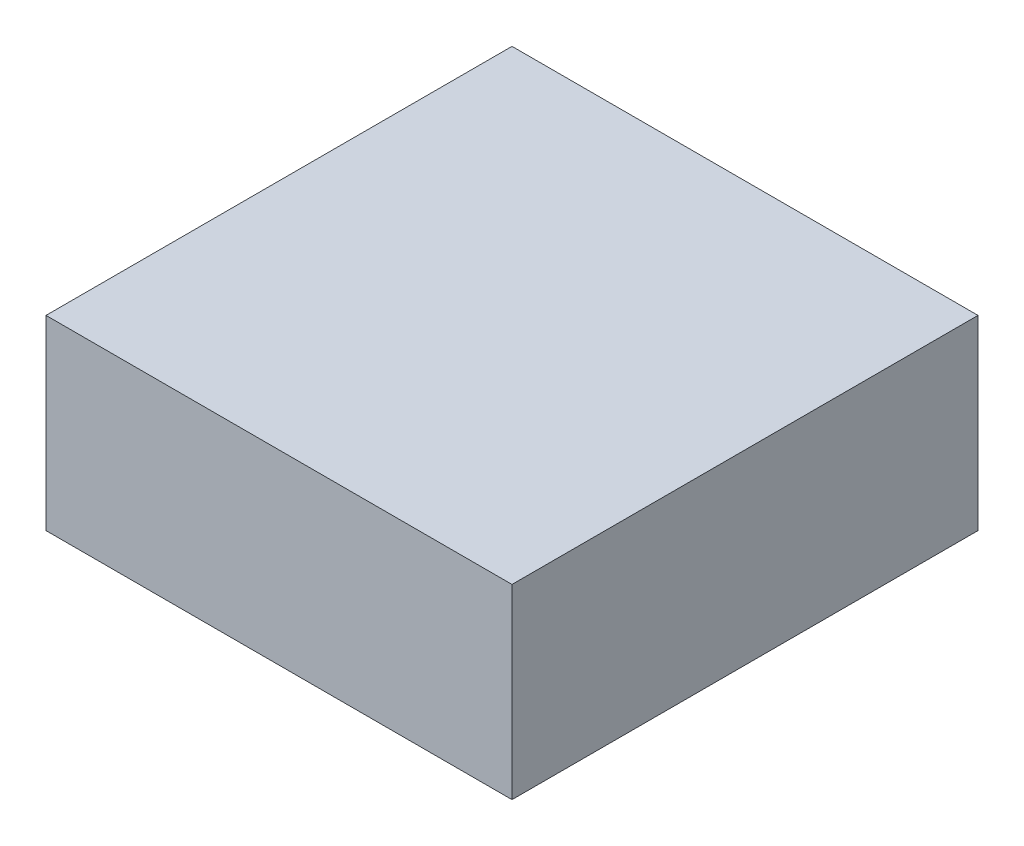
ISO-10303-21;
HEADER;
FILE_DESCRIPTION(('STEP AP214'),'2;1');
FILE_NAME('part.step','',(''),(''),'','','');
FILE_SCHEMA(('AUTOMOTIVE_DESIGN { 1 0 10303 214 1 1 1 1 }'));
ENDSEC;
DATA;
#1=APPLICATION_CONTEXT('core data for automotive mechanical design processes');
#2=APPLICATION_PROTOCOL_DEFINITION('international standard','automotive_design',2000,#1);
#3=PRODUCT_CONTEXT('',#1,'mechanical');
#4=PRODUCT('Part','Part','',(#3));
#5=PRODUCT_RELATED_PRODUCT_CATEGORY('part','',(#4));
#6=PRODUCT_DEFINITION_FORMATION('','',#4);
#7=PRODUCT_DEFINITION_CONTEXT('part definition',#1,'design');
#8=PRODUCT_DEFINITION('design','',#6,#7);
#9=PRODUCT_DEFINITION_SHAPE('','',#8);
#10=(LENGTH_UNIT() NAMED_UNIT(*) SI_UNIT(.MILLI.,.METRE.));
#11=(NAMED_UNIT(*) PLANE_ANGLE_UNIT() SI_UNIT($,.RADIAN.));
#12=(NAMED_UNIT(*) SI_UNIT($,.STERADIAN.) SOLID_ANGLE_UNIT());
#13=UNCERTAINTY_MEASURE_WITH_UNIT(LENGTH_MEASURE(1.E-05),#10,'distance_accuracy_value','');
#14=(GEOMETRIC_REPRESENTATION_CONTEXT(3) GLOBAL_UNCERTAINTY_ASSIGNED_CONTEXT((#13)) GLOBAL_UNIT_ASSIGNED_CONTEXT((#10,
#11,#12)) REPRESENTATION_CONTEXT('',''));
#15=CARTESIAN_POINT('',(0.,0.,0.));
#16=DIRECTION('',(0.,0.,1.));
#17=DIRECTION('',(1.,0.,0.));
#18=AXIS2_PLACEMENT_3D('',#15,#16,#17);
#19=CARTESIAN_POINT('',(-25.,20.,-25.));
#20=DIRECTION('',(1.,0.,0.));
#21=DIRECTION('',(0.,0.,-1.));
#22=AXIS2_PLACEMENT_3D('',#19,#20,#21);
#23=PLANE('',#22);
#24=DIRECTION('',(0.,0.,1.));
#25=VECTOR('',#24,1.);
#26=CARTESIAN_POINT('',(-25.,0.,-25.));
#27=LINE('',#26,#25);
#28=CARTESIAN_POINT('',(-25.,0.,-25.));
#29=VERTEX_POINT('',#28);
#30=CARTESIAN_POINT('',(-25.,0.,25.));
#31=VERTEX_POINT('',#30);
#32=EDGE_CURVE('E76',#29,#31,#27,.T.);
#33=ORIENTED_EDGE('',*,*,#32,.T.);
#34=DIRECTION('',(0.,-1.,0.));
#35=VECTOR('',#34,1.);
#36=CARTESIAN_POINT('',(-25.,20.,25.));
#37=LINE('',#36,#35);
#38=CARTESIAN_POINT('',(-25.,20.,25.));
#39=VERTEX_POINT('',#38);
#40=EDGE_CURVE('E11',#39,#31,#37,.T.);
#41=ORIENTED_EDGE('',*,*,#40,.F.);
#42=DIRECTION('',(0.,0.,1.));
#43=VECTOR('',#42,1.);
#44=CARTESIAN_POINT('',(-25.,20.,-25.));
#45=LINE('',#44,#43);
#46=CARTESIAN_POINT('',(-25.,20.,-25.));
#47=VERTEX_POINT('',#46);
#48=EDGE_CURVE('E94',#47,#39,#45,.T.);
#49=ORIENTED_EDGE('',*,*,#48,.F.);
#50=DIRECTION('',(0.,-1.,0.));
#51=VECTOR('',#50,1.);
#52=CARTESIAN_POINT('',(-25.,20.,-25.));
#53=LINE('',#52,#51);
#54=EDGE_CURVE('E88',#47,#29,#53,.T.);
#55=ORIENTED_EDGE('',*,*,#54,.T.);
#56=EDGE_LOOP('',(#33,#41,#49,#55));
#57=FACE_BOUND('',#56,.T.);
#58=ADVANCED_FACE('F32',(#57),#23,.F.);
#59=CARTESIAN_POINT('',(-25.,20.,25.));
#60=DIRECTION('',(0.,0.,-1.));
#61=DIRECTION('',(-1.,0.,0.));
#62=AXIS2_PLACEMENT_3D('',#59,#60,#61);
#63=PLANE('',#62);
#64=DIRECTION('',(1.,0.,0.));
#65=VECTOR('',#64,1.);
#66=CARTESIAN_POINT('',(-25.,0.,25.));
#67=LINE('',#66,#65);
#68=CARTESIAN_POINT('',(25.,0.,25.));
#69=VERTEX_POINT('',#68);
#70=EDGE_CURVE('E72',#31,#69,#67,.T.);
#71=ORIENTED_EDGE('',*,*,#70,.T.);
#72=DIRECTION('',(0.,-1.,0.));
#73=VECTOR('',#72,1.);
#74=CARTESIAN_POINT('',(25.,20.,25.));
#75=LINE('',#74,#73);
#76=CARTESIAN_POINT('',(25.,20.,25.));
#77=VERTEX_POINT('',#76);
#78=EDGE_CURVE('E39',#77,#69,#75,.T.);
#79=ORIENTED_EDGE('',*,*,#78,.F.);
#80=DIRECTION('',(1.,0.,0.));
#81=VECTOR('',#80,1.);
#82=CARTESIAN_POINT('',(-25.,20.,25.));
#83=LINE('',#82,#81);
#84=EDGE_CURVE('E84',#39,#77,#83,.T.);
#85=ORIENTED_EDGE('',*,*,#84,.F.);
#86=ORIENTED_EDGE('',*,*,#40,.T.);
#87=EDGE_LOOP('',(#71,#79,#85,#86));
#88=FACE_BOUND('',#87,.T.);
#89=ADVANCED_FACE('F83',(#88),#63,.F.);
#90=CARTESIAN_POINT('',(25.,20.,-25.));
#91=DIRECTION('',(-1.,0.,0.));
#92=DIRECTION('',(0.,0.,1.));
#93=AXIS2_PLACEMENT_3D('',#90,#91,#92);
#94=PLANE('',#93);
#95=DIRECTION('',(0.,0.,-1.));
#96=VECTOR('',#95,1.);
#97=CARTESIAN_POINT('',(25.,0.,-25.));
#98=LINE('',#97,#96);
#99=CARTESIAN_POINT('',(25.,0.,-25.));
#100=VERTEX_POINT('',#99);
#101=EDGE_CURVE('E77',#69,#100,#98,.T.);
#102=ORIENTED_EDGE('',*,*,#101,.T.);
#103=DIRECTION('',(0.,-1.,0.));
#104=VECTOR('',#103,1.);
#105=CARTESIAN_POINT('',(25.,20.,-25.));
#106=LINE('',#105,#104);
#107=CARTESIAN_POINT('',(25.,20.,-25.));
#108=VERTEX_POINT('',#107);
#109=EDGE_CURVE('E100',#108,#100,#106,.T.);
#110=ORIENTED_EDGE('',*,*,#109,.F.);
#111=DIRECTION('',(0.,0.,-1.));
#112=VECTOR('',#111,1.);
#113=CARTESIAN_POINT('',(25.,20.,-25.));
#114=LINE('',#113,#112);
#115=EDGE_CURVE('E51',#77,#108,#114,.T.);
#116=ORIENTED_EDGE('',*,*,#115,.F.);
#117=ORIENTED_EDGE('',*,*,#78,.T.);
#118=EDGE_LOOP('',(#102,#110,#116,#117));
#119=FACE_BOUND('',#118,.T.);
#120=ADVANCED_FACE('F103',(#119),#94,.F.);
#121=CARTESIAN_POINT('',(-25.,20.,-25.));
#122=DIRECTION('',(0.,0.,1.));
#123=DIRECTION('',(1.,0.,0.));
#124=AXIS2_PLACEMENT_3D('',#121,#122,#123);
#125=PLANE('',#124);
#126=DIRECTION('',(-1.,0.,0.));
#127=VECTOR('',#126,1.);
#128=CARTESIAN_POINT('',(-25.,0.,-25.));
#129=LINE('',#128,#127);
#130=EDGE_CURVE('E92',#100,#29,#129,.T.);
#131=ORIENTED_EDGE('',*,*,#130,.T.);
#132=ORIENTED_EDGE('',*,*,#54,.F.);
#133=DIRECTION('',(-1.,0.,0.));
#134=VECTOR('',#133,1.);
#135=CARTESIAN_POINT('',(-25.,20.,-25.));
#136=LINE('',#135,#134);
#137=EDGE_CURVE('E46',#108,#47,#136,.T.);
#138=ORIENTED_EDGE('',*,*,#137,.F.);
#139=ORIENTED_EDGE('',*,*,#109,.T.);
#140=EDGE_LOOP('',(#131,#132,#138,#139));
#141=FACE_BOUND('',#140,.T.);
#142=ADVANCED_FACE('F105',(#141),#125,.F.);
#143=CARTESIAN_POINT('',(-25.,20.,-25.));
#144=DIRECTION('',(0.,1.,0.));
#145=DIRECTION('',(0.,0.,1.));
#146=AXIS2_PLACEMENT_3D('',#143,#144,#145);
#147=PLANE('',#146);
#148=ORIENTED_EDGE('',*,*,#48,.T.);
#149=ORIENTED_EDGE('',*,*,#84,.T.);
#150=ORIENTED_EDGE('',*,*,#115,.T.);
#151=ORIENTED_EDGE('',*,*,#137,.T.);
#152=EDGE_LOOP('',(#148,#149,#150,#151));
#153=FACE_BOUND('',#152,.T.);
#154=ADVANCED_FACE('F106',(#153),#147,.T.);
#155=CARTESIAN_POINT('',(-25.,0.,-25.));
#156=DIRECTION('',(0.,1.,0.));
#157=DIRECTION('',(0.,0.,1.));
#158=AXIS2_PLACEMENT_3D('',#155,#156,#157);
#159=PLANE('',#158);
#160=ORIENTED_EDGE('',*,*,#32,.F.);
#161=ORIENTED_EDGE('',*,*,#130,.F.);
#162=ORIENTED_EDGE('',*,*,#101,.F.);
#163=ORIENTED_EDGE('',*,*,#70,.F.);
#164=EDGE_LOOP('',(#160,#161,#162,#163));
#165=FACE_BOUND('',#164,.T.);
#166=ADVANCED_FACE('F73',(#165),#159,.F.);
#167=CLOSED_SHELL('',(#58,#89,#120,#142,#154,#166));
#168=MANIFOLD_SOLID_BREP('B2',#167);
#169=ADVANCED_BREP_SHAPE_REPRESENTATION('',(#18,#168),#14);
#170=SHAPE_DEFINITION_REPRESENTATION(#9,#169);
ENDSEC;
END-ISO-10303-21;
